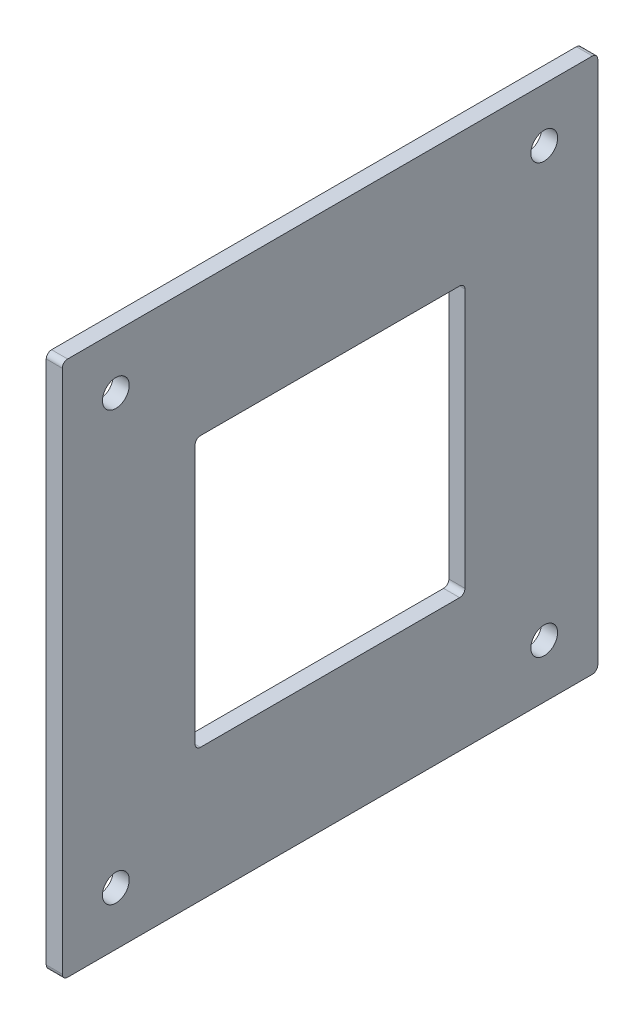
ISO-10303-21;
HEADER;
FILE_DESCRIPTION(('STEP AP214'),'2;1');
FILE_NAME('part.step','',(''),(''),'','','');
FILE_SCHEMA(('AUTOMOTIVE_DESIGN { 1 0 10303 214 1 1 1 1 }'));
ENDSEC;
DATA;
#1=APPLICATION_CONTEXT('core data for automotive mechanical design processes');
#2=APPLICATION_PROTOCOL_DEFINITION('international standard','automotive_design',2000,#1);
#3=PRODUCT_CONTEXT('',#1,'mechanical');
#4=PRODUCT('Part','Part','',(#3));
#5=PRODUCT_RELATED_PRODUCT_CATEGORY('part','',(#4));
#6=PRODUCT_DEFINITION_FORMATION('','',#4);
#7=PRODUCT_DEFINITION_CONTEXT('part definition',#1,'design');
#8=PRODUCT_DEFINITION('design','',#6,#7);
#9=PRODUCT_DEFINITION_SHAPE('','',#8);
#10=(LENGTH_UNIT() NAMED_UNIT(*) SI_UNIT(.MILLI.,.METRE.));
#11=(NAMED_UNIT(*) PLANE_ANGLE_UNIT() SI_UNIT($,.RADIAN.));
#12=(NAMED_UNIT(*) SI_UNIT($,.STERADIAN.) SOLID_ANGLE_UNIT());
#13=UNCERTAINTY_MEASURE_WITH_UNIT(LENGTH_MEASURE(1.E-05),#10,'distance_accuracy_value','');
#14=(GEOMETRIC_REPRESENTATION_CONTEXT(3) GLOBAL_UNCERTAINTY_ASSIGNED_CONTEXT((#13)) GLOBAL_UNIT_ASSIGNED_CONTEXT((#10,
#11,#12)) REPRESENTATION_CONTEXT('',''));
#15=CARTESIAN_POINT('',(0.,0.,0.));
#16=DIRECTION('',(0.,0.,1.));
#17=DIRECTION('',(1.,0.,0.));
#18=AXIS2_PLACEMENT_3D('',#15,#16,#17);
#19=CARTESIAN_POINT('',(0.,0.,0.));
#20=DIRECTION('',(-1.,0.,0.));
#21=DIRECTION('',(0.,0.,1.));
#22=AXIS2_PLACEMENT_3D('',#19,#20,#21);
#23=PLANE('',#22);
#24=CARTESIAN_POINT('',(0.,40.,-40.));
#25=DIRECTION('',(1.,0.,0.));
#26=DIRECTION('',(0.,0.,-1.));
#27=AXIS2_PLACEMENT_3D('',#24,#25,#26);
#28=CIRCLE('',#27,2.49999999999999);
#29=CARTESIAN_POINT('',(0.,40.,-42.5));
#30=VERTEX_POINT('',#29);
#31=EDGE_CURVE('E584',#30,#30,#28,.T.);
#32=ORIENTED_EDGE('',*,*,#31,.F.);
#33=EDGE_LOOP('',(#32));
#34=FACE_BOUND('',#33,.T.);
#35=CARTESIAN_POINT('',(0.,-40.,40.));
#36=DIRECTION('',(1.,0.,0.));
#37=DIRECTION('',(0.,0.,-1.));
#38=AXIS2_PLACEMENT_3D('',#35,#36,#37);
#39=CIRCLE('',#38,2.49999999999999);
#40=CARTESIAN_POINT('',(0.,-40.,37.5));
#41=VERTEX_POINT('',#40);
#42=EDGE_CURVE('E575',#41,#41,#39,.T.);
#43=ORIENTED_EDGE('',*,*,#42,.F.);
#44=EDGE_LOOP('',(#43));
#45=FACE_BOUND('',#44,.T.);
#46=DIRECTION('',(0.,0.,1.));
#47=VECTOR('',#46,1.);
#48=CARTESIAN_POINT('',(0.,25.2,25.2));
#49=LINE('',#48,#47);
#50=CARTESIAN_POINT('',(0.,25.2,-24.2));
#51=VERTEX_POINT('',#50);
#52=CARTESIAN_POINT('',(0.,25.2,24.2));
#53=VERTEX_POINT('',#52);
#54=EDGE_CURVE('E282',#51,#53,#49,.T.);
#55=ORIENTED_EDGE('',*,*,#54,.F.);
#56=CARTESIAN_POINT('',(0.,24.2,-24.2));
#57=DIRECTION('',(-1.,0.,0.));
#58=DIRECTION('',(0.,0.,1.));
#59=AXIS2_PLACEMENT_3D('',#56,#57,#58);
#60=CIRCLE('',#59,1.);
#61=CARTESIAN_POINT('',(0.,24.2,-25.2));
#62=VERTEX_POINT('',#61);
#63=EDGE_CURVE('E245',#51,#62,#60,.T.);
#64=ORIENTED_EDGE('',*,*,#63,.T.);
#65=DIRECTION('',(0.,1.,0.));
#66=VECTOR('',#65,1.);
#67=CARTESIAN_POINT('',(0.,-25.2,-25.2));
#68=LINE('',#67,#66);
#69=CARTESIAN_POINT('',(0.,-24.2,-25.2));
#70=VERTEX_POINT('',#69);
#71=EDGE_CURVE('E254',#70,#62,#68,.T.);
#72=ORIENTED_EDGE('',*,*,#71,.F.);
#73=CARTESIAN_POINT('',(0.,-24.2,-24.2));
#74=DIRECTION('',(-1.,0.,0.));
#75=DIRECTION('',(0.,0.,1.));
#76=AXIS2_PLACEMENT_3D('',#73,#74,#75);
#77=CIRCLE('',#76,1.);
#78=CARTESIAN_POINT('',(0.,-25.2,-24.2));
#79=VERTEX_POINT('',#78);
#80=EDGE_CURVE('E55',#70,#79,#77,.T.);
#81=ORIENTED_EDGE('',*,*,#80,.T.);
#82=DIRECTION('',(0.,0.,-1.));
#83=VECTOR('',#82,1.);
#84=CARTESIAN_POINT('',(0.,-25.2,25.2));
#85=LINE('',#84,#83);
#86=CARTESIAN_POINT('',(0.,-25.2,24.2));
#87=VERTEX_POINT('',#86);
#88=EDGE_CURVE('E253',#87,#79,#85,.T.);
#89=ORIENTED_EDGE('',*,*,#88,.F.);
#90=CARTESIAN_POINT('',(0.,-24.2,24.2));
#91=DIRECTION('',(-1.,0.,0.));
#92=DIRECTION('',(0.,0.,1.));
#93=AXIS2_PLACEMENT_3D('',#90,#91,#92);
#94=CIRCLE('',#93,1.);
#95=CARTESIAN_POINT('',(0.,-24.2,25.2));
#96=VERTEX_POINT('',#95);
#97=EDGE_CURVE('E237',#87,#96,#94,.T.);
#98=ORIENTED_EDGE('',*,*,#97,.T.);
#99=DIRECTION('',(0.,-1.,0.));
#100=VECTOR('',#99,1.);
#101=CARTESIAN_POINT('',(0.,-25.2,25.2));
#102=LINE('',#101,#100);
#103=CARTESIAN_POINT('',(0.,24.2,25.2));
#104=VERTEX_POINT('',#103);
#105=EDGE_CURVE('E263',#104,#96,#102,.T.);
#106=ORIENTED_EDGE('',*,*,#105,.F.);
#107=CARTESIAN_POINT('',(0.,24.2,24.2));
#108=DIRECTION('',(-1.,0.,0.));
#109=DIRECTION('',(0.,0.,1.));
#110=AXIS2_PLACEMENT_3D('',#107,#108,#109);
#111=CIRCLE('',#110,1.);
#112=EDGE_CURVE('E241',#104,#53,#111,.T.);
#113=ORIENTED_EDGE('',*,*,#112,.T.);
#114=EDGE_LOOP('',(#55,#64,#72,#81,#89,#98,#106,#113));
#115=FACE_BOUND('',#114,.T.);
#116=DIRECTION('',(0.,0.,-1.));
#117=VECTOR('',#116,1.);
#118=CARTESIAN_POINT('',(0.,-50.,50.));
#119=LINE('',#118,#117);
#120=CARTESIAN_POINT('',(0.,-50.,49.));
#121=VERTEX_POINT('',#120);
#122=CARTESIAN_POINT('',(0.,-50.,-49.));
#123=VERTEX_POINT('',#122);
#124=EDGE_CURVE('E163',#121,#123,#119,.T.);
#125=ORIENTED_EDGE('',*,*,#124,.T.);
#126=CARTESIAN_POINT('',(0.,-49.,-49.));
#127=DIRECTION('',(-1.,0.,0.));
#128=DIRECTION('',(0.,0.,1.));
#129=AXIS2_PLACEMENT_3D('',#126,#127,#128);
#130=CIRCLE('',#129,1.);
#131=CARTESIAN_POINT('',(0.,-49.,-50.));
#132=VERTEX_POINT('',#131);
#133=EDGE_CURVE('E170',#123,#132,#130,.F.);
#134=ORIENTED_EDGE('',*,*,#133,.T.);
#135=DIRECTION('',(0.,1.,0.));
#136=VECTOR('',#135,1.);
#137=CARTESIAN_POINT('',(0.,-50.,-50.));
#138=LINE('',#137,#136);
#139=CARTESIAN_POINT('',(0.,49.,-50.));
#140=VERTEX_POINT('',#139);
#141=EDGE_CURVE('E280',#132,#140,#138,.T.);
#142=ORIENTED_EDGE('',*,*,#141,.T.);
#143=CARTESIAN_POINT('',(0.,49.,-49.));
#144=DIRECTION('',(-1.,0.,0.));
#145=DIRECTION('',(0.,0.,1.));
#146=AXIS2_PLACEMENT_3D('',#143,#144,#145);
#147=CIRCLE('',#146,1.);
#148=CARTESIAN_POINT('',(0.,50.,-49.));
#149=VERTEX_POINT('',#148);
#150=EDGE_CURVE('E188',#140,#149,#147,.F.);
#151=ORIENTED_EDGE('',*,*,#150,.T.);
#152=DIRECTION('',(0.,0.,1.));
#153=VECTOR('',#152,1.);
#154=CARTESIAN_POINT('',(0.,50.,50.));
#155=LINE('',#154,#153);
#156=CARTESIAN_POINT('',(0.,50.,49.));
#157=VERTEX_POINT('',#156);
#158=EDGE_CURVE('E296',#149,#157,#155,.T.);
#159=ORIENTED_EDGE('',*,*,#158,.T.);
#160=CARTESIAN_POINT('',(0.,49.,49.));
#161=DIRECTION('',(-1.,0.,0.));
#162=DIRECTION('',(0.,0.,1.));
#163=AXIS2_PLACEMENT_3D('',#160,#161,#162);
#164=CIRCLE('',#163,1.);
#165=CARTESIAN_POINT('',(0.,49.,50.));
#166=VERTEX_POINT('',#165);
#167=EDGE_CURVE('E171',#157,#166,#164,.F.);
#168=ORIENTED_EDGE('',*,*,#167,.T.);
#169=DIRECTION('',(0.,-1.,0.));
#170=VECTOR('',#169,1.);
#171=CARTESIAN_POINT('',(0.,-50.,50.));
#172=LINE('',#171,#170);
#173=CARTESIAN_POINT('',(0.,-49.,50.));
#174=VERTEX_POINT('',#173);
#175=EDGE_CURVE('E165',#166,#174,#172,.T.);
#176=ORIENTED_EDGE('',*,*,#175,.T.);
#177=CARTESIAN_POINT('',(0.,-49.,49.));
#178=DIRECTION('',(-1.,0.,0.));
#179=DIRECTION('',(0.,0.,1.));
#180=AXIS2_PLACEMENT_3D('',#177,#178,#179);
#181=CIRCLE('',#180,1.);
#182=EDGE_CURVE('E160',#174,#121,#181,.F.);
#183=ORIENTED_EDGE('',*,*,#182,.T.);
#184=EDGE_LOOP('',(#125,#134,#142,#151,#159,#168,#176,#183));
#185=FACE_BOUND('',#184,.T.);
#186=CARTESIAN_POINT('',(0.,-40.,-40.));
#187=DIRECTION('',(1.,0.,0.));
#188=DIRECTION('',(0.,0.,-1.));
#189=AXIS2_PLACEMENT_3D('',#186,#187,#188);
#190=CIRCLE('',#189,2.49999999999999);
#191=CARTESIAN_POINT('',(0.,-40.,-42.5));
#192=VERTEX_POINT('',#191);
#193=EDGE_CURVE('E578',#192,#192,#190,.T.);
#194=ORIENTED_EDGE('',*,*,#193,.F.);
#195=EDGE_LOOP('',(#194));
#196=FACE_BOUND('',#195,.T.);
#197=CARTESIAN_POINT('',(0.,40.,40.));
#198=DIRECTION('',(1.,0.,0.));
#199=DIRECTION('',(0.,0.,-1.));
#200=AXIS2_PLACEMENT_3D('',#197,#198,#199);
#201=CIRCLE('',#200,2.49999999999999);
#202=CARTESIAN_POINT('',(0.,40.,37.5));
#203=VERTEX_POINT('',#202);
#204=EDGE_CURVE('E588',#203,#203,#201,.T.);
#205=ORIENTED_EDGE('',*,*,#204,.F.);
#206=EDGE_LOOP('',(#205));
#207=FACE_BOUND('',#206,.T.);
#208=ADVANCED_FACE('F47',(#34,#45,#115,#185,#196,#207),#23,.F.);
#209=CARTESIAN_POINT('',(-3.,-50.,-50.));
#210=DIRECTION('',(0.,0.,-1.));
#211=DIRECTION('',(-1.,0.,0.));
#212=AXIS2_PLACEMENT_3D('',#209,#210,#211);
#213=PLANE('',#212);
#214=ORIENTED_EDGE('',*,*,#141,.F.);
#215=DIRECTION('',(1.,0.,0.));
#216=VECTOR('',#215,1.);
#217=CARTESIAN_POINT('',(-3.,-49.,-50.));
#218=LINE('',#217,#216);
#219=CARTESIAN_POINT('',(-3.,-49.,-50.));
#220=VERTEX_POINT('',#219);
#221=EDGE_CURVE('E200',#132,#220,#218,.F.);
#222=ORIENTED_EDGE('',*,*,#221,.T.);
#223=DIRECTION('',(0.,1.,0.));
#224=VECTOR('',#223,1.);
#225=CARTESIAN_POINT('',(-3.,-50.,-50.));
#226=LINE('',#225,#224);
#227=CARTESIAN_POINT('',(-3.,49.,-50.));
#228=VERTEX_POINT('',#227);
#229=EDGE_CURVE('E181',#220,#228,#226,.T.);
#230=ORIENTED_EDGE('',*,*,#229,.T.);
#231=DIRECTION('',(1.,0.,0.));
#232=VECTOR('',#231,1.);
#233=CARTESIAN_POINT('',(-3.,49.,-50.));
#234=LINE('',#233,#232);
#235=EDGE_CURVE('E197',#228,#140,#234,.T.);
#236=ORIENTED_EDGE('',*,*,#235,.T.);
#237=EDGE_LOOP('',(#214,#222,#230,#236));
#238=FACE_BOUND('',#237,.T.);
#239=ADVANCED_FACE('F314',(#238),#213,.T.);
#240=CARTESIAN_POINT('',(-3.,-50.,50.));
#241=DIRECTION('',(0.,-1.,0.));
#242=DIRECTION('',(0.,0.,-1.));
#243=AXIS2_PLACEMENT_3D('',#240,#241,#242);
#244=PLANE('',#243);
#245=DIRECTION('',(0.,0.,-1.));
#246=VECTOR('',#245,1.);
#247=CARTESIAN_POINT('',(-3.,-50.,50.));
#248=LINE('',#247,#246);
#249=CARTESIAN_POINT('',(-3.,-50.,49.));
#250=VERTEX_POINT('',#249);
#251=CARTESIAN_POINT('',(-3.,-50.,-49.));
#252=VERTEX_POINT('',#251);
#253=EDGE_CURVE('E186',#250,#252,#248,.T.);
#254=ORIENTED_EDGE('',*,*,#253,.T.);
#255=DIRECTION('',(1.,0.,0.));
#256=VECTOR('',#255,1.);
#257=CARTESIAN_POINT('',(-3.,-50.,-49.));
#258=LINE('',#257,#256);
#259=EDGE_CURVE('E180',#252,#123,#258,.T.);
#260=ORIENTED_EDGE('',*,*,#259,.T.);
#261=ORIENTED_EDGE('',*,*,#124,.F.);
#262=DIRECTION('',(1.,0.,0.));
#263=VECTOR('',#262,1.);
#264=CARTESIAN_POINT('',(-3.,-50.,49.));
#265=LINE('',#264,#263);
#266=EDGE_CURVE('E177',#121,#250,#265,.F.);
#267=ORIENTED_EDGE('',*,*,#266,.T.);
#268=EDGE_LOOP('',(#254,#260,#261,#267));
#269=FACE_BOUND('',#268,.T.);
#270=ADVANCED_FACE('F176',(#269),#244,.T.);
#271=CARTESIAN_POINT('',(-3.,-50.,50.));
#272=DIRECTION('',(0.,0.,1.));
#273=DIRECTION('',(1.,0.,0.));
#274=AXIS2_PLACEMENT_3D('',#271,#272,#273);
#275=PLANE('',#274);
#276=DIRECTION('',(0.,-1.,0.));
#277=VECTOR('',#276,1.);
#278=CARTESIAN_POINT('',(-3.,-50.,50.));
#279=LINE('',#278,#277);
#280=CARTESIAN_POINT('',(-3.,49.,50.));
#281=VERTEX_POINT('',#280);
#282=CARTESIAN_POINT('',(-3.,-49.,50.));
#283=VERTEX_POINT('',#282);
#284=EDGE_CURVE('E190',#281,#283,#279,.T.);
#285=ORIENTED_EDGE('',*,*,#284,.T.);
#286=DIRECTION('',(1.,0.,0.));
#287=VECTOR('',#286,1.);
#288=CARTESIAN_POINT('',(-3.,-49.,50.));
#289=LINE('',#288,#287);
#290=EDGE_CURVE('E211',#283,#174,#289,.T.);
#291=ORIENTED_EDGE('',*,*,#290,.T.);
#292=ORIENTED_EDGE('',*,*,#175,.F.);
#293=DIRECTION('',(1.,0.,0.));
#294=VECTOR('',#293,1.);
#295=CARTESIAN_POINT('',(-3.,49.,50.));
#296=LINE('',#295,#294);
#297=EDGE_CURVE('E209',#166,#281,#296,.F.);
#298=ORIENTED_EDGE('',*,*,#297,.T.);
#299=EDGE_LOOP('',(#285,#291,#292,#298));
#300=FACE_BOUND('',#299,.T.);
#301=ADVANCED_FACE('F321',(#300),#275,.T.);
#302=CARTESIAN_POINT('',(-3.,50.,50.));
#303=DIRECTION('',(0.,1.,0.));
#304=DIRECTION('',(0.,0.,1.));
#305=AXIS2_PLACEMENT_3D('',#302,#303,#304);
#306=PLANE('',#305);
#307=DIRECTION('',(0.,0.,1.));
#308=VECTOR('',#307,1.);
#309=CARTESIAN_POINT('',(-3.,50.,50.));
#310=LINE('',#309,#308);
#311=CARTESIAN_POINT('',(-3.,50.,-49.));
#312=VERTEX_POINT('',#311);
#313=CARTESIAN_POINT('',(-3.,50.,49.));
#314=VERTEX_POINT('',#313);
#315=EDGE_CURVE('E289',#312,#314,#310,.T.);
#316=ORIENTED_EDGE('',*,*,#315,.T.);
#317=DIRECTION('',(1.,0.,0.));
#318=VECTOR('',#317,1.);
#319=CARTESIAN_POINT('',(-3.,50.,49.));
#320=LINE('',#319,#318);
#321=EDGE_CURVE('E215',#314,#157,#320,.T.);
#322=ORIENTED_EDGE('',*,*,#321,.T.);
#323=ORIENTED_EDGE('',*,*,#158,.F.);
#324=DIRECTION('',(1.,0.,0.));
#325=VECTOR('',#324,1.);
#326=CARTESIAN_POINT('',(-3.,50.,-49.));
#327=LINE('',#326,#325);
#328=EDGE_CURVE('E213',#149,#312,#327,.F.);
#329=ORIENTED_EDGE('',*,*,#328,.T.);
#330=EDGE_LOOP('',(#316,#322,#323,#329));
#331=FACE_BOUND('',#330,.T.);
#332=ADVANCED_FACE('F301',(#331),#306,.T.);
#333=CARTESIAN_POINT('',(-3.,0.,0.));
#334=DIRECTION('',(-1.,0.,0.));
#335=DIRECTION('',(0.,0.,1.));
#336=AXIS2_PLACEMENT_3D('',#333,#334,#335);
#337=PLANE('',#336);
#338=CARTESIAN_POINT('',(-3.,40.,40.));
#339=DIRECTION('',(-1.,0.,0.));
#340=DIRECTION('',(0.,0.,1.));
#341=AXIS2_PLACEMENT_3D('',#338,#339,#340);
#342=CIRCLE('',#341,2.5);
#343=CARTESIAN_POINT('',(-3.,40.,42.5));
#344=VERTEX_POINT('',#343);
#345=EDGE_CURVE('E395',#344,#344,#342,.T.);
#346=ORIENTED_EDGE('',*,*,#345,.F.);
#347=EDGE_LOOP('',(#346));
#348=FACE_BOUND('',#347,.T.);
#349=CARTESIAN_POINT('',(-3.,40.,-40.));
#350=DIRECTION('',(-1.,0.,0.));
#351=DIRECTION('',(0.,0.,1.));
#352=AXIS2_PLACEMENT_3D('',#349,#350,#351);
#353=CIRCLE('',#352,2.5);
#354=CARTESIAN_POINT('',(-3.,40.,-37.5));
#355=VERTEX_POINT('',#354);
#356=EDGE_CURVE('E399',#355,#355,#353,.T.);
#357=ORIENTED_EDGE('',*,*,#356,.F.);
#358=EDGE_LOOP('',(#357));
#359=FACE_BOUND('',#358,.T.);
#360=CARTESIAN_POINT('',(-3.,-40.,-40.));
#361=DIRECTION('',(-1.,0.,0.));
#362=DIRECTION('',(0.,0.,1.));
#363=AXIS2_PLACEMENT_3D('',#360,#361,#362);
#364=CIRCLE('',#363,2.5);
#365=CARTESIAN_POINT('',(-3.,-40.,-37.5));
#366=VERTEX_POINT('',#365);
#367=EDGE_CURVE('E403',#366,#366,#364,.T.);
#368=ORIENTED_EDGE('',*,*,#367,.F.);
#369=EDGE_LOOP('',(#368));
#370=FACE_BOUND('',#369,.T.);
#371=CARTESIAN_POINT('',(-3.,-40.,40.));
#372=DIRECTION('',(-1.,0.,0.));
#373=DIRECTION('',(0.,0.,1.));
#374=AXIS2_PLACEMENT_3D('',#371,#372,#373);
#375=CIRCLE('',#374,2.5);
#376=CARTESIAN_POINT('',(-3.,-40.,42.5));
#377=VERTEX_POINT('',#376);
#378=EDGE_CURVE('E273',#377,#377,#375,.T.);
#379=ORIENTED_EDGE('',*,*,#378,.F.);
#380=EDGE_LOOP('',(#379));
#381=FACE_BOUND('',#380,.T.);
#382=DIRECTION('',(0.,0.,-1.));
#383=VECTOR('',#382,1.);
#384=CARTESIAN_POINT('',(-3.,-25.2,25.2));
#385=LINE('',#384,#383);
#386=CARTESIAN_POINT('',(-3.,-25.2,24.2));
#387=VERTEX_POINT('',#386);
#388=CARTESIAN_POINT('',(-3.,-25.2,-24.2));
#389=VERTEX_POINT('',#388);
#390=EDGE_CURVE('E278',#387,#389,#385,.T.);
#391=ORIENTED_EDGE('',*,*,#390,.T.);
#392=CARTESIAN_POINT('',(-3.,-24.2,-24.2));
#393=DIRECTION('',(-1.,0.,0.));
#394=DIRECTION('',(0.,0.,1.));
#395=AXIS2_PLACEMENT_3D('',#392,#393,#394);
#396=CIRCLE('',#395,1.);
#397=CARTESIAN_POINT('',(-3.,-24.2,-25.2));
#398=VERTEX_POINT('',#397);
#399=EDGE_CURVE('E13',#389,#398,#396,.F.);
#400=ORIENTED_EDGE('',*,*,#399,.T.);
#401=DIRECTION('',(0.,1.,0.));
#402=VECTOR('',#401,1.);
#403=CARTESIAN_POINT('',(-3.,-25.2,-25.2));
#404=LINE('',#403,#402);
#405=CARTESIAN_POINT('',(-3.,24.2,-25.2));
#406=VERTEX_POINT('',#405);
#407=EDGE_CURVE('E262',#398,#406,#404,.T.);
#408=ORIENTED_EDGE('',*,*,#407,.T.);
#409=CARTESIAN_POINT('',(-3.,24.2,-24.2));
#410=DIRECTION('',(-1.,0.,0.));
#411=DIRECTION('',(0.,0.,1.));
#412=AXIS2_PLACEMENT_3D('',#409,#410,#411);
#413=CIRCLE('',#412,1.);
#414=CARTESIAN_POINT('',(-3.,25.2,-24.2));
#415=VERTEX_POINT('',#414);
#416=EDGE_CURVE('E247',#406,#415,#413,.F.);
#417=ORIENTED_EDGE('',*,*,#416,.T.);
#418=DIRECTION('',(0.,0.,1.));
#419=VECTOR('',#418,1.);
#420=CARTESIAN_POINT('',(-3.,25.2,25.2));
#421=LINE('',#420,#419);
#422=CARTESIAN_POINT('',(-3.,25.2,24.2));
#423=VERTEX_POINT('',#422);
#424=EDGE_CURVE('E267',#415,#423,#421,.T.);
#425=ORIENTED_EDGE('',*,*,#424,.T.);
#426=CARTESIAN_POINT('',(-3.,24.2,24.2));
#427=DIRECTION('',(-1.,0.,0.));
#428=DIRECTION('',(0.,0.,1.));
#429=AXIS2_PLACEMENT_3D('',#426,#427,#428);
#430=CIRCLE('',#429,1.);
#431=CARTESIAN_POINT('',(-3.,24.2,25.2));
#432=VERTEX_POINT('',#431);
#433=EDGE_CURVE('E243',#423,#432,#430,.F.);
#434=ORIENTED_EDGE('',*,*,#433,.T.);
#435=DIRECTION('',(0.,-1.,0.));
#436=VECTOR('',#435,1.);
#437=CARTESIAN_POINT('',(-3.,-25.2,25.2));
#438=LINE('',#437,#436);
#439=CARTESIAN_POINT('',(-3.,-24.2,25.2));
#440=VERTEX_POINT('',#439);
#441=EDGE_CURVE('E270',#432,#440,#438,.T.);
#442=ORIENTED_EDGE('',*,*,#441,.T.);
#443=CARTESIAN_POINT('',(-3.,-24.2,24.2));
#444=DIRECTION('',(-1.,0.,0.));
#445=DIRECTION('',(0.,0.,1.));
#446=AXIS2_PLACEMENT_3D('',#443,#444,#445);
#447=CIRCLE('',#446,1.);
#448=EDGE_CURVE('E239',#440,#387,#447,.F.);
#449=ORIENTED_EDGE('',*,*,#448,.T.);
#450=EDGE_LOOP('',(#391,#400,#408,#417,#425,#434,#442,#449));
#451=FACE_BOUND('',#450,.T.);
#452=ORIENTED_EDGE('',*,*,#229,.F.);
#453=CARTESIAN_POINT('',(-3.,-49.,-49.));
#454=DIRECTION('',(-1.,0.,0.));
#455=DIRECTION('',(0.,0.,1.));
#456=AXIS2_PLACEMENT_3D('',#453,#454,#455);
#457=CIRCLE('',#456,1.);
#458=EDGE_CURVE('E207',#220,#252,#457,.T.);
#459=ORIENTED_EDGE('',*,*,#458,.T.);
#460=ORIENTED_EDGE('',*,*,#253,.F.);
#461=CARTESIAN_POINT('',(-3.,-49.,49.));
#462=DIRECTION('',(-1.,0.,0.));
#463=DIRECTION('',(0.,0.,1.));
#464=AXIS2_PLACEMENT_3D('',#461,#462,#463);
#465=CIRCLE('',#464,1.);
#466=EDGE_CURVE('E185',#250,#283,#465,.T.);
#467=ORIENTED_EDGE('',*,*,#466,.T.);
#468=ORIENTED_EDGE('',*,*,#284,.F.);
#469=CARTESIAN_POINT('',(-3.,49.,49.));
#470=DIRECTION('',(-1.,0.,0.));
#471=DIRECTION('',(0.,0.,1.));
#472=AXIS2_PLACEMENT_3D('',#469,#470,#471);
#473=CIRCLE('',#472,1.);
#474=EDGE_CURVE('E204',#281,#314,#473,.T.);
#475=ORIENTED_EDGE('',*,*,#474,.T.);
#476=ORIENTED_EDGE('',*,*,#315,.F.);
#477=CARTESIAN_POINT('',(-3.,49.,-49.));
#478=DIRECTION('',(-1.,0.,0.));
#479=DIRECTION('',(0.,0.,1.));
#480=AXIS2_PLACEMENT_3D('',#477,#478,#479);
#481=CIRCLE('',#480,1.);
#482=EDGE_CURVE('E202',#312,#228,#481,.T.);
#483=ORIENTED_EDGE('',*,*,#482,.T.);
#484=EDGE_LOOP('',(#452,#459,#460,#467,#468,#475,#476,#483));
#485=FACE_BOUND('',#484,.T.);
#486=ADVANCED_FACE('F310',(#348,#359,#370,#381,#451,#485),#337,.T.);
#487=CARTESIAN_POINT('',(-3.,-25.2,-25.2));
#488=DIRECTION('',(0.,0.,-1.));
#489=DIRECTION('',(-1.,0.,0.));
#490=AXIS2_PLACEMENT_3D('',#487,#488,#489);
#491=PLANE('',#490);
#492=ORIENTED_EDGE('',*,*,#71,.T.);
#493=DIRECTION('',(1.,0.,0.));
#494=VECTOR('',#493,1.);
#495=CARTESIAN_POINT('',(-3.,24.2,-25.2));
#496=LINE('',#495,#494);
#497=EDGE_CURVE('E62',#62,#406,#496,.F.);
#498=ORIENTED_EDGE('',*,*,#497,.T.);
#499=ORIENTED_EDGE('',*,*,#407,.F.);
#500=DIRECTION('',(1.,0.,0.));
#501=VECTOR('',#500,1.);
#502=CARTESIAN_POINT('',(0.,-24.2,-25.2));
#503=LINE('',#502,#501);
#504=EDGE_CURVE('E233',#398,#70,#503,.T.);
#505=ORIENTED_EDGE('',*,*,#504,.T.);
#506=EDGE_LOOP('',(#492,#498,#499,#505));
#507=FACE_BOUND('',#506,.T.);
#508=ADVANCED_FACE('F265',(#507),#491,.F.);
#509=CARTESIAN_POINT('',(-3.,-25.2,25.2));
#510=DIRECTION('',(0.,-1.,0.));
#511=DIRECTION('',(0.,0.,-1.));
#512=AXIS2_PLACEMENT_3D('',#509,#510,#511);
#513=PLANE('',#512);
#514=ORIENTED_EDGE('',*,*,#390,.F.);
#515=DIRECTION('',(1.,0.,0.));
#516=VECTOR('',#515,1.);
#517=CARTESIAN_POINT('',(0.,-25.2,24.2));
#518=LINE('',#517,#516);
#519=EDGE_CURVE('E220',#387,#87,#518,.T.);
#520=ORIENTED_EDGE('',*,*,#519,.T.);
#521=ORIENTED_EDGE('',*,*,#88,.T.);
#522=DIRECTION('',(1.,0.,0.));
#523=VECTOR('',#522,1.);
#524=CARTESIAN_POINT('',(-3.,-25.2,-24.2));
#525=LINE('',#524,#523);
#526=EDGE_CURVE('E218',#79,#389,#525,.F.);
#527=ORIENTED_EDGE('',*,*,#526,.T.);
#528=EDGE_LOOP('',(#514,#520,#521,#527));
#529=FACE_BOUND('',#528,.T.);
#530=ADVANCED_FACE('F260',(#529),#513,.F.);
#531=CARTESIAN_POINT('',(-3.,-25.2,25.2));
#532=DIRECTION('',(0.,0.,1.));
#533=DIRECTION('',(1.,0.,0.));
#534=AXIS2_PLACEMENT_3D('',#531,#532,#533);
#535=PLANE('',#534);
#536=ORIENTED_EDGE('',*,*,#105,.T.);
#537=DIRECTION('',(1.,0.,0.));
#538=VECTOR('',#537,1.);
#539=CARTESIAN_POINT('',(-3.,-24.2,25.2));
#540=LINE('',#539,#538);
#541=EDGE_CURVE('E226',#96,#440,#540,.F.);
#542=ORIENTED_EDGE('',*,*,#541,.T.);
#543=ORIENTED_EDGE('',*,*,#441,.F.);
#544=DIRECTION('',(1.,0.,0.));
#545=VECTOR('',#544,1.);
#546=CARTESIAN_POINT('',(0.,24.2,25.2));
#547=LINE('',#546,#545);
#548=EDGE_CURVE('E223',#432,#104,#547,.T.);
#549=ORIENTED_EDGE('',*,*,#548,.T.);
#550=EDGE_LOOP('',(#536,#542,#543,#549));
#551=FACE_BOUND('',#550,.T.);
#552=ADVANCED_FACE('F379',(#551),#535,.F.);
#553=CARTESIAN_POINT('',(-3.,25.2,25.2));
#554=DIRECTION('',(0.,1.,0.));
#555=DIRECTION('',(0.,0.,1.));
#556=AXIS2_PLACEMENT_3D('',#553,#554,#555);
#557=PLANE('',#556);
#558=ORIENTED_EDGE('',*,*,#54,.T.);
#559=DIRECTION('',(1.,0.,0.));
#560=VECTOR('',#559,1.);
#561=CARTESIAN_POINT('',(-3.,25.2,24.2));
#562=LINE('',#561,#560);
#563=EDGE_CURVE('E231',#53,#423,#562,.F.);
#564=ORIENTED_EDGE('',*,*,#563,.T.);
#565=ORIENTED_EDGE('',*,*,#424,.F.);
#566=DIRECTION('',(1.,0.,0.));
#567=VECTOR('',#566,1.);
#568=CARTESIAN_POINT('',(0.,25.2,-24.2));
#569=LINE('',#568,#567);
#570=EDGE_CURVE('E228',#415,#51,#569,.T.);
#571=ORIENTED_EDGE('',*,*,#570,.T.);
#572=EDGE_LOOP('',(#558,#564,#565,#571));
#573=FACE_BOUND('',#572,.T.);
#574=ADVANCED_FACE('F375',(#573),#557,.F.);
#575=CARTESIAN_POINT('',(0.,-40.,40.));
#576=DIRECTION('',(1.,0.,0.));
#577=DIRECTION('',(0.,0.,-1.));
#578=AXIS2_PLACEMENT_3D('',#575,#576,#577);
#579=CYLINDRICAL_SURFACE('',#578,2.5);
#580=ORIENTED_EDGE('',*,*,#42,.T.);
#581=EDGE_LOOP('',(#580));
#582=FACE_BOUND('',#581,.T.);
#583=ORIENTED_EDGE('',*,*,#378,.T.);
#584=EDGE_LOOP('',(#583));
#585=FACE_BOUND('',#584,.T.);
#586=ADVANCED_FACE('F371',(#582,#585),#579,.F.);
#587=CARTESIAN_POINT('',(0.,-40.,-40.));
#588=DIRECTION('',(1.,0.,0.));
#589=DIRECTION('',(0.,0.,-1.));
#590=AXIS2_PLACEMENT_3D('',#587,#588,#589);
#591=CYLINDRICAL_SURFACE('',#590,2.5);
#592=ORIENTED_EDGE('',*,*,#193,.T.);
#593=EDGE_LOOP('',(#592));
#594=FACE_BOUND('',#593,.T.);
#595=ORIENTED_EDGE('',*,*,#367,.T.);
#596=EDGE_LOOP('',(#595));
#597=FACE_BOUND('',#596,.T.);
#598=ADVANCED_FACE('F363',(#594,#597),#591,.F.);
#599=CARTESIAN_POINT('',(0.,40.,-40.));
#600=DIRECTION('',(1.,0.,0.));
#601=DIRECTION('',(0.,0.,-1.));
#602=AXIS2_PLACEMENT_3D('',#599,#600,#601);
#603=CYLINDRICAL_SURFACE('',#602,2.5);
#604=ORIENTED_EDGE('',*,*,#31,.T.);
#605=EDGE_LOOP('',(#604));
#606=FACE_BOUND('',#605,.T.);
#607=ORIENTED_EDGE('',*,*,#356,.T.);
#608=EDGE_LOOP('',(#607));
#609=FACE_BOUND('',#608,.T.);
#610=ADVANCED_FACE('F357',(#606,#609),#603,.F.);
#611=CARTESIAN_POINT('',(0.,40.,40.));
#612=DIRECTION('',(1.,0.,0.));
#613=DIRECTION('',(0.,0.,-1.));
#614=AXIS2_PLACEMENT_3D('',#611,#612,#613);
#615=CYLINDRICAL_SURFACE('',#614,2.5);
#616=ORIENTED_EDGE('',*,*,#204,.T.);
#617=EDGE_LOOP('',(#616));
#618=FACE_BOUND('',#617,.T.);
#619=ORIENTED_EDGE('',*,*,#345,.T.);
#620=EDGE_LOOP('',(#619));
#621=FACE_BOUND('',#620,.T.);
#622=ADVANCED_FACE('F353',(#618,#621),#615,.F.);
#623=CARTESIAN_POINT('',(-3.,-49.,-49.));
#624=DIRECTION('',(1.,0.,0.));
#625=DIRECTION('',(0.,0.,-1.));
#626=AXIS2_PLACEMENT_3D('',#623,#624,#625);
#627=CYLINDRICAL_SURFACE('',#626,1.);
#628=ORIENTED_EDGE('',*,*,#458,.F.);
#629=ORIENTED_EDGE('',*,*,#221,.F.);
#630=ORIENTED_EDGE('',*,*,#133,.F.);
#631=ORIENTED_EDGE('',*,*,#259,.F.);
#632=EDGE_LOOP('',(#628,#629,#630,#631));
#633=FACE_BOUND('',#632,.T.);
#634=ADVANCED_FACE('F317',(#633),#627,.T.);
#635=CARTESIAN_POINT('',(-3.,-49.,49.));
#636=DIRECTION('',(1.,0.,0.));
#637=DIRECTION('',(0.,0.,-1.));
#638=AXIS2_PLACEMENT_3D('',#635,#636,#637);
#639=CYLINDRICAL_SURFACE('',#638,1.);
#640=ORIENTED_EDGE('',*,*,#466,.F.);
#641=ORIENTED_EDGE('',*,*,#266,.F.);
#642=ORIENTED_EDGE('',*,*,#182,.F.);
#643=ORIENTED_EDGE('',*,*,#290,.F.);
#644=EDGE_LOOP('',(#640,#641,#642,#643));
#645=FACE_BOUND('',#644,.T.);
#646=ADVANCED_FACE('F184',(#645),#639,.T.);
#647=CARTESIAN_POINT('',(-3.,49.,49.));
#648=DIRECTION('',(1.,0.,0.));
#649=DIRECTION('',(0.,0.,-1.));
#650=AXIS2_PLACEMENT_3D('',#647,#648,#649);
#651=CYLINDRICAL_SURFACE('',#650,1.);
#652=ORIENTED_EDGE('',*,*,#474,.F.);
#653=ORIENTED_EDGE('',*,*,#297,.F.);
#654=ORIENTED_EDGE('',*,*,#167,.F.);
#655=ORIENTED_EDGE('',*,*,#321,.F.);
#656=EDGE_LOOP('',(#652,#653,#654,#655));
#657=FACE_BOUND('',#656,.T.);
#658=ADVANCED_FACE('F324',(#657),#651,.T.);
#659=CARTESIAN_POINT('',(-3.,49.,-49.));
#660=DIRECTION('',(1.,0.,0.));
#661=DIRECTION('',(0.,0.,-1.));
#662=AXIS2_PLACEMENT_3D('',#659,#660,#661);
#663=CYLINDRICAL_SURFACE('',#662,1.);
#664=ORIENTED_EDGE('',*,*,#482,.F.);
#665=ORIENTED_EDGE('',*,*,#328,.F.);
#666=ORIENTED_EDGE('',*,*,#150,.F.);
#667=ORIENTED_EDGE('',*,*,#235,.F.);
#668=EDGE_LOOP('',(#664,#665,#666,#667));
#669=FACE_BOUND('',#668,.T.);
#670=ADVANCED_FACE('F306',(#669),#663,.T.);
#671=CARTESIAN_POINT('',(-3.,-24.2,24.2));
#672=DIRECTION('',(-1.,0.,0.));
#673=DIRECTION('',(0.,0.,1.));
#674=AXIS2_PLACEMENT_3D('',#671,#672,#673);
#675=CYLINDRICAL_SURFACE('',#674,1.);
#676=ORIENTED_EDGE('',*,*,#448,.F.);
#677=ORIENTED_EDGE('',*,*,#541,.F.);
#678=ORIENTED_EDGE('',*,*,#97,.F.);
#679=ORIENTED_EDGE('',*,*,#519,.F.);
#680=EDGE_LOOP('',(#676,#677,#678,#679));
#681=FACE_BOUND('',#680,.T.);
#682=ADVANCED_FACE('F331',(#681),#675,.F.);
#683=CARTESIAN_POINT('',(-3.,24.2,24.2));
#684=DIRECTION('',(-1.,0.,0.));
#685=DIRECTION('',(0.,0.,1.));
#686=AXIS2_PLACEMENT_3D('',#683,#684,#685);
#687=CYLINDRICAL_SURFACE('',#686,1.);
#688=ORIENTED_EDGE('',*,*,#433,.F.);
#689=ORIENTED_EDGE('',*,*,#563,.F.);
#690=ORIENTED_EDGE('',*,*,#112,.F.);
#691=ORIENTED_EDGE('',*,*,#548,.F.);
#692=EDGE_LOOP('',(#688,#689,#690,#691));
#693=FACE_BOUND('',#692,.T.);
#694=ADVANCED_FACE('F414',(#693),#687,.F.);
#695=CARTESIAN_POINT('',(-3.,24.2,-24.2));
#696=DIRECTION('',(-1.,0.,0.));
#697=DIRECTION('',(0.,0.,1.));
#698=AXIS2_PLACEMENT_3D('',#695,#696,#697);
#699=CYLINDRICAL_SURFACE('',#698,1.);
#700=ORIENTED_EDGE('',*,*,#416,.F.);
#701=ORIENTED_EDGE('',*,*,#497,.F.);
#702=ORIENTED_EDGE('',*,*,#63,.F.);
#703=ORIENTED_EDGE('',*,*,#570,.F.);
#704=EDGE_LOOP('',(#700,#701,#702,#703));
#705=FACE_BOUND('',#704,.T.);
#706=ADVANCED_FACE('F419',(#705),#699,.F.);
#707=CARTESIAN_POINT('',(-3.,-24.2,-24.2));
#708=DIRECTION('',(-1.,0.,0.));
#709=DIRECTION('',(0.,0.,1.));
#710=AXIS2_PLACEMENT_3D('',#707,#708,#709);
#711=CYLINDRICAL_SURFACE('',#710,1.);
#712=ORIENTED_EDGE('',*,*,#399,.F.);
#713=ORIENTED_EDGE('',*,*,#526,.F.);
#714=ORIENTED_EDGE('',*,*,#80,.F.);
#715=ORIENTED_EDGE('',*,*,#504,.F.);
#716=EDGE_LOOP('',(#712,#713,#714,#715));
#717=FACE_BOUND('',#716,.T.);
#718=ADVANCED_FACE('F49',(#717),#711,.F.);
#719=CLOSED_SHELL('',(#208,#239,#270,#301,#332,#486,#508,#530,#552,#574,#586,#598,#610,#622,
#634,#646,#658,#670,#682,#694,#706,#718));
#720=MANIFOLD_SOLID_BREP('B2',#719);
#721=ADVANCED_BREP_SHAPE_REPRESENTATION('',(#18,#720),#14);
#722=SHAPE_DEFINITION_REPRESENTATION(#9,#721);
ENDSEC;
END-ISO-10303-21;
